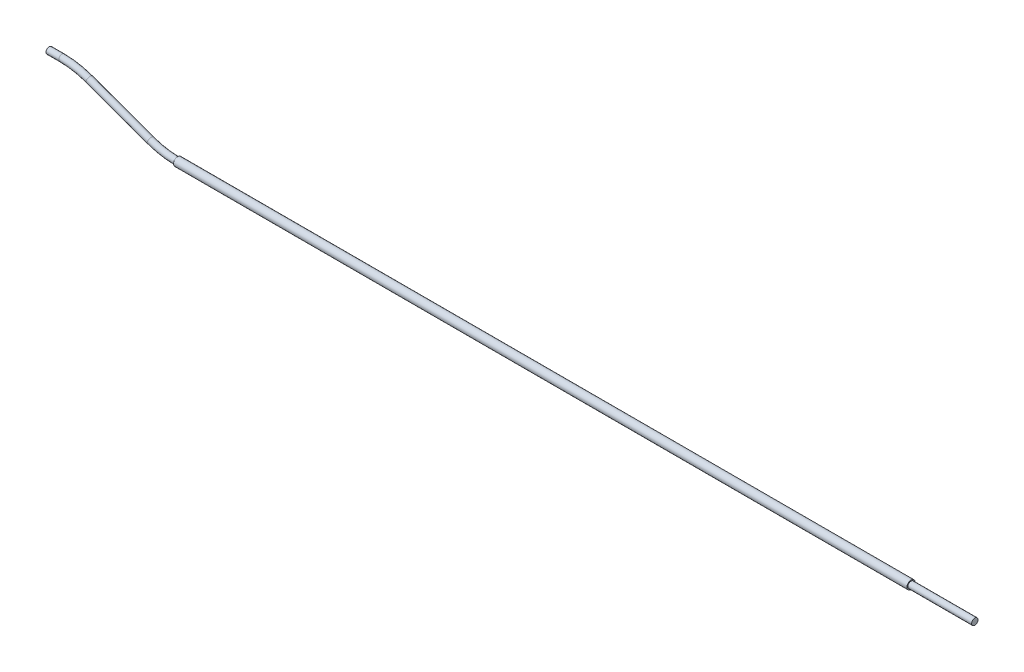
from build123d import *

# Parameters (mm, degrees)
SKETCH1_R           = 0.127
BOSS_EXTRUDE1_START = -2.54
SKETCH3_R           = 0.1651
SKETCH3_R_2         = 0.127
BOSS_EXTRUDE1_DEPTH = 29.21
SKETCH4_R           = 0.127
BOSS_EXTRUDE2_DEPTH = 0.508


with BuildPart() as part:
    # Sweep1: sweep along a path in Sketch2
    with BuildLine(Plane.XY) as sweep1_path:
        Line((0, 0), (-31.75, 0))
        ThreePointArc((-31.75, 0), (-32.301332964, 0.048235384), (-32.835913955, 0.191475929))
        Line((-32.835913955, 0.191475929), (-35.273058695, 1.078524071))
        ThreePointArc((-35.273058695, 1.078524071), (-35.807639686, 1.221764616), (-36.35897265, 1.27))
    # Sketch1 → Sweep1 (sweep)
    with BuildSketch(Plane(origin=(0, 0, 0), x_dir=(0, 0, -1), z_dir=(1, 0, 0))):
        Circle(SKETCH1_R)
    sweep(path=sweep1_path.line)

    # Sketch4 → Boss-Extrude2 (add)
    with BuildSketch(Plane.ZY.offset(36.35897265)):
        with Locations(Location((0, 1.27, 0), (0, 0, 90))):
            Circle(SKETCH4_R)
    extrude(amount=BOSS_EXTRUDE2_DEPTH)


with BuildPart() as body_2:
    # Sketch3 → Boss-Extrude1 (new body)
    with BuildSketch(Plane(origin=(0, 0, 0), x_dir=(0, 0, -1), z_dir=(1, 0, 0)).offset(BOSS_EXTRUDE1_START)):
        Circle(SKETCH3_R)
        Circle(SKETCH3_R_2, mode=Mode.SUBTRACT)
    extrude(amount=-BOSS_EXTRUDE1_DEPTH)


solid = Compound([part.part, body_2.part])
